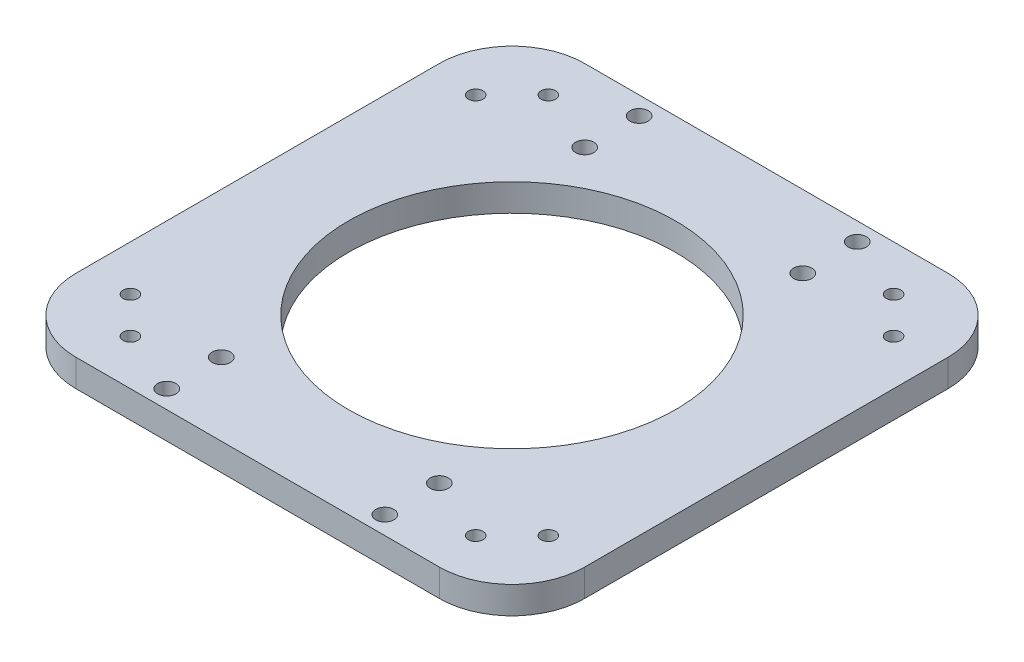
from build123d import *

# Parameters (mm, degrees)
SKETCH1_W           = 177.8
SKETCH1_H           = 177.8
BOSS_EXTRUDE1_DEPTH = 9.525
SKETCH2_R           = 57.15
CUT_EXTRUDE1_DEPTH  = 9.525
FILLET1_R           = 25.4
SKETCH3_R           = 3.175
CUT_EXTRUDE2_DEPTH  = 6.35
SKETCH4_R           = 2.5527
CUT_EXTRUDE3_DEPTH  = 127.083883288
SKETCH5_R           = 3.175
CUT_EXTRUDE4_DEPTH  = 6.35
SKETCH6_R           = 2.5527
CUT_EXTRUDE5_DEPTH  = 127.083883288


with BuildPart() as part:
    # Sketch1 → Boss-Extrude1 (new body)
    with BuildSketch(Plane(origin=(0, 0, 0), x_dir=(1, 0, 0), z_dir=(0, 1, 0))):
        Rectangle(SKETCH1_W, SKETCH1_H)
    extrude(amount=BOSS_EXTRUDE1_DEPTH)

    # Sketch2 → Cut-Extrude1 (cut)
    with BuildSketch(Plane(origin=(0, 9.525, 0), x_dir=(1, 0, 0), z_dir=(0, 1, 0))):
        with Locations(Location((0, 0, 0), (0, 0, 270))):
            Circle(SKETCH2_R)
    extrude(amount=-CUT_EXTRUDE1_DEPTH, mode=Mode.SUBTRACT)

    # Fillet1
    fillet1_edges = [part.edges().sort_by_distance(p)[0] for p in [
        (88.9, 4.7625, 88.9),
        (-88.9, 4.7625, 88.9),
        (-88.9, 4.7625, -88.9),
        (88.9, 4.7625, -88.9),
    ]]
    fillet(fillet1_edges, radius=FILLET1_R)

    # Sketch3 → Cut-Extrude2 (cut)
    with BuildSketch(Plane(origin=(0, 9.525, 0), x_dir=(1, 0, 0), z_dir=(0, 1, 0))):
        with Locations(Location((38.1, 82.55, 0), (0, 0, 270))):
            Circle(SKETCH3_R)
        with Locations(Location((38.1, 63.5, 0), (0, 0, 90))):
            Circle(SKETCH3_R)
        with Locations(Location((-38.1, 63.5, 0), (0, 0, 270))):
            Circle(SKETCH3_R)
        with Locations(Location((-38.1, 82.55, 0), (0, 0, 90))):
            Circle(SKETCH3_R)
        with Locations(Location((-38.1, -82.55, 0), (0, 0, 270))):
            Circle(SKETCH3_R)
        with Locations(Location((-38.1, -63.5, 0), (0, 0, 90))):
            Circle(SKETCH3_R)
        with Locations(Location((38.1, -63.5, 0), (0, 0, 270))):
            Circle(SKETCH3_R)
        with Locations(Location((38.1, -82.55, 0), (0, 0, 90))):
            Circle(SKETCH3_R)
    extrude(amount=-CUT_EXTRUDE2_DEPTH, mode=Mode.SUBTRACT)

    # Sketch4 → Cut-Extrude3 (cut, through all)
    with BuildSketch(Plane(origin=(0, 9.525, 0), x_dir=(1, 0, 0), z_dir=(0, 1, 0))):
        with Locations(Location((60.325, 73.025, 0), (0, 0, 270))):
            Circle(SKETCH4_R)
        with Locations(Location((-60.325, 73.025, 0), (0, 0, 270))):
            Circle(SKETCH4_R)
        with Locations(Location((-60.325, -73.025, 0), (0, 0, 270))):
            Circle(SKETCH4_R)
        with Locations(Location((60.325, -73.025, 0), (0, 0, 270))):
            Circle(SKETCH4_R)
    extrude(amount=-CUT_EXTRUDE3_DEPTH, mode=Mode.SUBTRACT)

    # Sketch5 → Cut-Extrude4 (cut)
    with BuildSketch(Plane.XZ):
        with Locations(Location((-82.55, 38.1, 0), (0, 0, 270))):
            Circle(SKETCH5_R)
        with Locations(Location((-63.5, 38.1, 0), (0, 0, 90))):
            Circle(SKETCH5_R)
        with Locations(Location((-63.5, -38.1, 0), (0, 0, 270))):
            Circle(SKETCH5_R)
        with Locations(Location((-82.55, -38.1, 0), (0, 0, 90))):
            Circle(SKETCH5_R)
        with Locations(Location((62.865, 38.1, 0), (0, 0, 270))):
            Circle(SKETCH5_R)
        with Locations(Location((62.865, -38.1, 0), (0, 0, 90))):
            Circle(SKETCH5_R)
        with Locations(Location((81.915, -38.1, 0), (0, 0, 270))):
            Circle(SKETCH5_R)
        with Locations(Location((81.915, 38.1, 0), (0, 0, 90))):
            Circle(SKETCH5_R)
    extrude(amount=-CUT_EXTRUDE4_DEPTH, mode=Mode.SUBTRACT)

    # Sketch6 → Cut-Extrude5 (cut, through all)
    with BuildSketch(Plane.XZ):
        with Locations(Location((-73.025, 60.325, 0), (0, 0, 270))):
            Circle(SKETCH6_R)
        with Locations(Location((73.025, 60.325, 0), (0, 0, 270))):
            Circle(SKETCH6_R)
        with Locations(Location((73.025, -60.325, 0), (0, 0, 270))):
            Circle(SKETCH6_R)
        with Locations(Location((-73.025, -60.325, 0), (0, 0, 270))):
            Circle(SKETCH6_R)
    extrude(amount=-CUT_EXTRUDE5_DEPTH, mode=Mode.SUBTRACT)


solid = part.part
